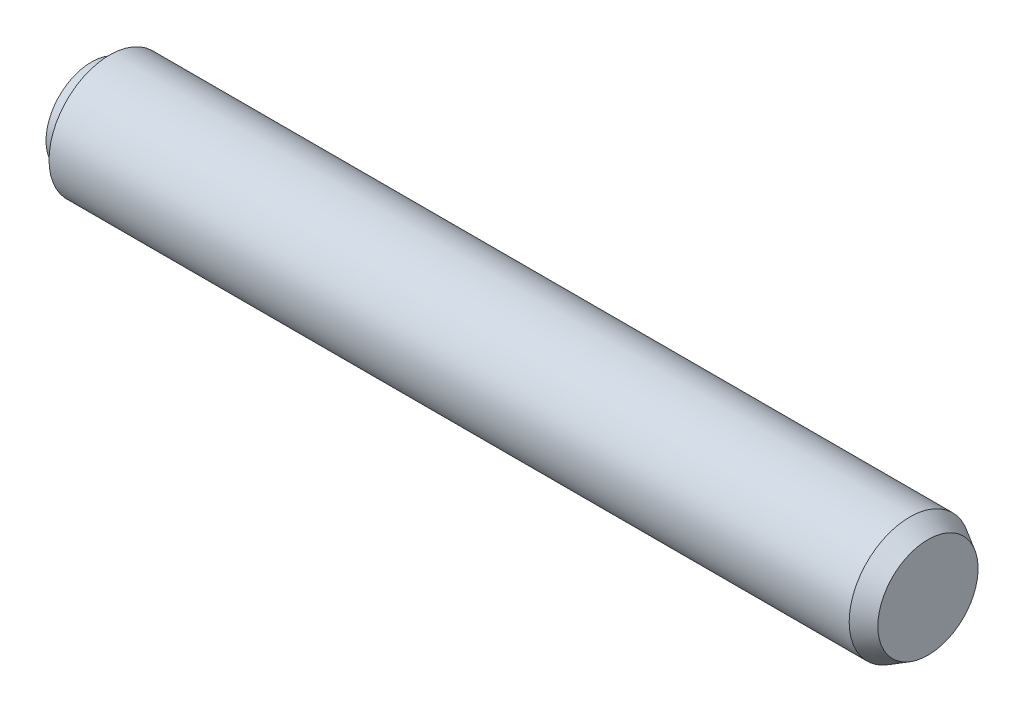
ISO-10303-21;
HEADER;
FILE_DESCRIPTION(('STEP AP214'),'2;1');
FILE_NAME('part.step','',(''),(''),'','','');
FILE_SCHEMA(('AUTOMOTIVE_DESIGN { 1 0 10303 214 1 1 1 1 }'));
ENDSEC;
DATA;
#1=APPLICATION_CONTEXT('core data for automotive mechanical design processes');
#2=APPLICATION_PROTOCOL_DEFINITION('international standard','automotive_design',2000,#1);
#3=PRODUCT_CONTEXT('',#1,'mechanical');
#4=PRODUCT('Part','Part','',(#3));
#5=PRODUCT_RELATED_PRODUCT_CATEGORY('part','',(#4));
#6=PRODUCT_DEFINITION_FORMATION('','',#4);
#7=PRODUCT_DEFINITION_CONTEXT('part definition',#1,'design');
#8=PRODUCT_DEFINITION('design','',#6,#7);
#9=PRODUCT_DEFINITION_SHAPE('','',#8);
#10=(LENGTH_UNIT() NAMED_UNIT(*) SI_UNIT(.MILLI.,.METRE.));
#11=(NAMED_UNIT(*) PLANE_ANGLE_UNIT() SI_UNIT($,.RADIAN.));
#12=(NAMED_UNIT(*) SI_UNIT($,.STERADIAN.) SOLID_ANGLE_UNIT());
#13=UNCERTAINTY_MEASURE_WITH_UNIT(LENGTH_MEASURE(1.E-05),#10,'distance_accuracy_value','');
#14=(GEOMETRIC_REPRESENTATION_CONTEXT(3) GLOBAL_UNCERTAINTY_ASSIGNED_CONTEXT((#13)) GLOBAL_UNIT_ASSIGNED_CONTEXT((#10,
#11,#12)) REPRESENTATION_CONTEXT('',''));
#15=CARTESIAN_POINT('',(0.,0.,0.));
#16=DIRECTION('',(0.,0.,1.));
#17=DIRECTION('',(1.,0.,0.));
#18=AXIS2_PLACEMENT_3D('',#15,#16,#17);
#19=CARTESIAN_POINT('',(0.,0.,0.));
#20=DIRECTION('',(1.,0.,0.));
#21=DIRECTION('',(0.,0.,-1.));
#22=AXIS2_PLACEMENT_3D('',#19,#20,#21);
#23=PLANE('',#22);
#24=CARTESIAN_POINT('',(0.,0.,0.));
#25=DIRECTION('',(-1.,0.,0.));
#26=DIRECTION('',(0.,0.,1.));
#27=AXIS2_PLACEMENT_3D('',#24,#25,#26);
#28=CIRCLE('',#27,7.49999999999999);
#29=CARTESIAN_POINT('',(0.,0.,7.49999999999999));
#30=VERTEX_POINT('',#29);
#31=EDGE_CURVE('E39',#30,#30,#28,.T.);
#32=ORIENTED_EDGE('',*,*,#31,.T.);
#33=EDGE_LOOP('',(#32));
#34=FACE_BOUND('',#33,.T.);
#35=ADVANCED_FACE('F29',(#34),#23,.F.);
#36=CARTESIAN_POINT('',(0.,0.,0.));
#37=DIRECTION('',(-1.,0.,0.));
#38=DIRECTION('',(0.,0.,1.));
#39=AXIS2_PLACEMENT_3D('',#36,#37,#38);
#40=CYLINDRICAL_SURFACE('',#39,7.49999999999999);
#41=ORIENTED_EDGE('',*,*,#31,.F.);
#42=EDGE_LOOP('',(#41));
#43=FACE_BOUND('',#42,.T.);
#44=CARTESIAN_POINT('',(3.,0.,0.));
#45=DIRECTION('',(-1.,0.,0.));
#46=DIRECTION('',(0.,0.,1.));
#47=AXIS2_PLACEMENT_3D('',#44,#45,#46);
#48=CIRCLE('',#47,7.49999999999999);
#49=CARTESIAN_POINT('',(3.,0.,7.49999999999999));
#50=VERTEX_POINT('',#49);
#51=EDGE_CURVE('E43',#50,#50,#48,.T.);
#52=ORIENTED_EDGE('',*,*,#51,.T.);
#53=EDGE_LOOP('',(#52));
#54=FACE_BOUND('',#53,.T.);
#55=ADVANCED_FACE('F64',(#43,#54),#40,.T.);
#56=CARTESIAN_POINT('',(3.,7.49999999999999,0.));
#57=DIRECTION('',(1.,0.,0.));
#58=DIRECTION('',(0.,0.,-1.));
#59=AXIS2_PLACEMENT_3D('',#56,#57,#58);
#60=PLANE('',#59);
#61=ORIENTED_EDGE('',*,*,#51,.F.);
#62=EDGE_LOOP('',(#61));
#63=FACE_BOUND('',#62,.T.);
#64=CARTESIAN_POINT('',(3.,0.,0.));
#65=DIRECTION('',(-1.,0.,0.));
#66=DIRECTION('',(0.,0.,1.));
#67=AXIS2_PLACEMENT_3D('',#64,#65,#66);
#68=CIRCLE('',#67,9.99999999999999);
#69=CARTESIAN_POINT('',(3.,0.,9.99999999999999));
#70=VERTEX_POINT('',#69);
#71=EDGE_CURVE('E48',#70,#70,#68,.T.);
#72=ORIENTED_EDGE('',*,*,#71,.T.);
#73=EDGE_LOOP('',(#72));
#74=FACE_BOUND('',#73,.T.);
#75=ADVANCED_FACE('F52',(#63,#74),#60,.F.);
#76=CARTESIAN_POINT('',(0.,0.,0.));
#77=DIRECTION('',(-1.,0.,0.));
#78=DIRECTION('',(0.,0.,1.));
#79=AXIS2_PLACEMENT_3D('',#76,#77,#78);
#80=CYLINDRICAL_SURFACE('',#79,9.99999999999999);
#81=CARTESIAN_POINT('',(135.,0.,0.));
#82=DIRECTION('',(-1.,0.,0.));
#83=DIRECTION('',(0.,0.,1.));
#84=AXIS2_PLACEMENT_3D('',#81,#82,#83);
#85=CIRCLE('',#84,9.99999999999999);
#86=CARTESIAN_POINT('',(135.,0.,9.99999999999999));
#87=VERTEX_POINT('',#86);
#88=EDGE_CURVE('E35',#87,#87,#85,.T.);
#89=ORIENTED_EDGE('',*,*,#88,.T.);
#90=EDGE_LOOP('',(#89));
#91=FACE_BOUND('',#90,.T.);
#92=ORIENTED_EDGE('',*,*,#71,.F.);
#93=EDGE_LOOP('',(#92));
#94=FACE_BOUND('',#93,.T.);
#95=ADVANCED_FACE('F54',(#91,#94),#80,.T.);
#96=CARTESIAN_POINT('',(138.,9.99999999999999,0.));
#97=DIRECTION('',(-1.,0.,0.));
#98=DIRECTION('',(0.,0.,1.));
#99=AXIS2_PLACEMENT_3D('',#96,#97,#98);
#100=PLANE('',#99);
#101=CARTESIAN_POINT('',(138.,0.,0.));
#102=DIRECTION('',(-1.,0.,0.));
#103=DIRECTION('',(0.,0.,1.));
#104=AXIS2_PLACEMENT_3D('',#101,#102,#103);
#105=CIRCLE('',#104,8.26794919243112);
#106=CARTESIAN_POINT('',(138.,0.,8.26794919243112));
#107=VERTEX_POINT('',#106);
#108=EDGE_CURVE('E10',#107,#107,#105,.F.);
#109=ORIENTED_EDGE('',*,*,#108,.T.);
#110=EDGE_LOOP('',(#109));
#111=FACE_BOUND('',#110,.T.);
#112=ADVANCED_FACE('F56',(#111),#100,.F.);
#113=CARTESIAN_POINT('',(135.,0.,0.));
#114=DIRECTION('',(-1.,0.,0.));
#115=DIRECTION('',(0.,0.,1.));
#116=AXIS2_PLACEMENT_3D('',#113,#114,#115);
#117=CONICAL_SURFACE('',#116,9.99999999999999,0.523598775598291);
#118=ORIENTED_EDGE('',*,*,#108,.F.);
#119=EDGE_LOOP('',(#118));
#120=FACE_BOUND('',#119,.T.);
#121=ORIENTED_EDGE('',*,*,#88,.F.);
#122=EDGE_LOOP('',(#121));
#123=FACE_BOUND('',#122,.T.);
#124=ADVANCED_FACE('F62',(#120,#123),#117,.T.);
#125=CLOSED_SHELL('',(#35,#55,#75,#95,#112,#124));
#126=MANIFOLD_SOLID_BREP('B2',#125);
#127=ADVANCED_BREP_SHAPE_REPRESENTATION('',(#18,#126),#14);
#128=SHAPE_DEFINITION_REPRESENTATION(#9,#127);
ENDSEC;
END-ISO-10303-21;
